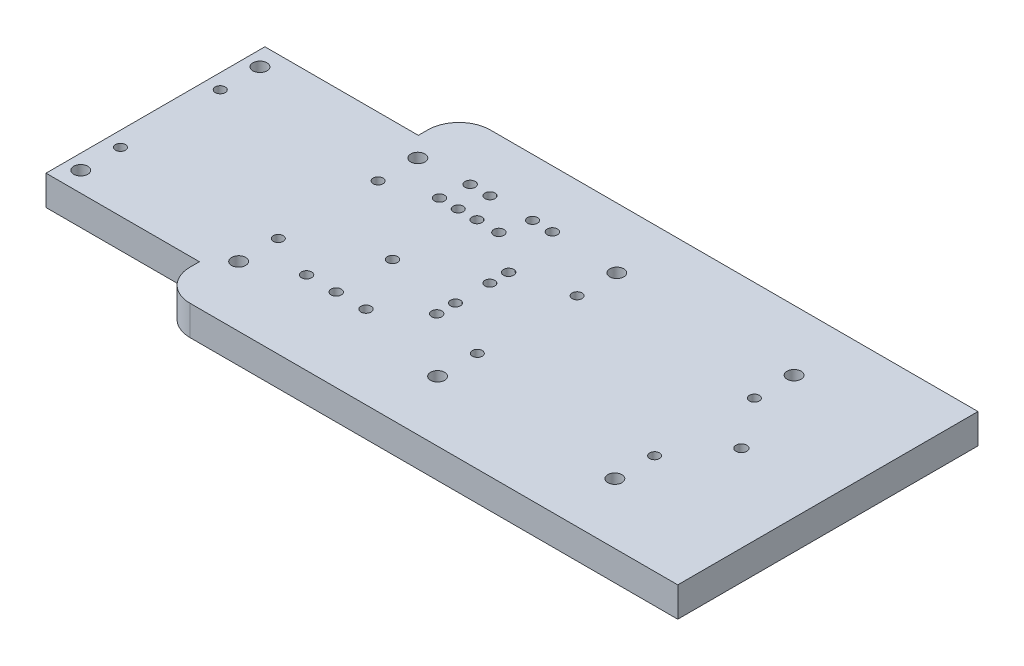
from build123d import *

# Parameters (mm, degrees)
SKETCH1_W                                      = 221.25
SKETCH1_H                                      = 100
BOSS_EXTRUDE1_DEPTH                            = 9.525
CUT_EXTRUDE3_REACH                             = 144.64
SKETCH4_W                                      = 53
SKETCH4_H                                      = 15
SKETCH5_W                                      = 70
SKETCH5_H                                      = 9.525
CUT_EXTRUDE4_DEPTH                             = 3.95
CUT_EXTRUDE5_REACH                             = 144.64
SKETCH6_W                                      = 168.25
SKETCH6_H                                      = 2
TAP_DRILL_FOR_8_32_TAP1_D                      = 3.4544
TAP_DRILL_FOR_8_32_TAP1_DEPTH                  = 6.35
TAP_DRILL_FOR_8_32_TAP1_TIP                    = 1.037806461
CBORE_FOR_8_SOCKET_HEAD_CAP_SCREW1_D           = 4.4958
CBORE_FOR_8_SOCKET_HEAD_CAP_SCREW1_CBORE_D     = 7.9375
CBORE_FOR_8_SOCKET_HEAD_CAP_SCREW1_CBORE_DEPTH = 4.1656
F_1_8_0_125_PRESS_DOWEL_HOLE1_D                = 3.175
TAP_DRILL_FOR_8_32_TAP2_D                      = 3.4544
TAP_DRILL_FOR_8_32_TAP2_DEPTH                  = 6.35
TAP_DRILL_FOR_8_32_TAP2_TIP                    = 1.037806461
CBORE_FOR_4_SOCKET_HEAD_CAP_SCREW1_D           = 3.2639
CBORE_FOR_4_SOCKET_HEAD_CAP_SCREW1_CBORE_D     = 5.55752
CBORE_FOR_4_SOCKET_HEAD_CAP_SCREW1_CBORE_DEPTH = 2.8448
F_1_8_0_125_PRESS_DOWEL_HOLE2_D                = 3.175
F_1_8_0_125_PRESS_DOWEL_HOLE3_D                = 3.175
CBORE_FOR_4_SOCKET_HEAD_CAP_SCREW2_D           = 3.2639
CBORE_FOR_4_SOCKET_HEAD_CAP_SCREW2_CBORE_D     = 5.55752
CBORE_FOR_4_SOCKET_HEAD_CAP_SCREW2_CBORE_DEPTH = 2.8448
CBORE_FOR_4_SOCKET_HEAD_CAP_SCREW3_D           = 3.2639
CBORE_FOR_4_SOCKET_HEAD_CAP_SCREW3_CBORE_D     = 5.55752
CBORE_FOR_4_SOCKET_HEAD_CAP_SCREW3_CBORE_DEPTH = 2.8448
CBORE_FOR_4_SOCKET_HEAD_CAP_SCREW4_D           = 3.2639
CBORE_FOR_4_SOCKET_HEAD_CAP_SCREW4_CBORE_D     = 5.55752
CBORE_FOR_4_SOCKET_HEAD_CAP_SCREW4_CBORE_DEPTH = 2.8448
F_1_8_0_125_PRESS_DOWEL_HOLE4_D                = 3.175
FILLET1_R                                      = 10
SKETCH75_W                                     = 2.3
SKETCH75_H                                     = 96
CUT_EXTRUDE6_DEPTH                             = 10


with BuildPart() as part:
    # Sketch1 → Boss-Extrude1 (new body)
    with BuildSketch(Plane(origin=(0, 0, 0), x_dir=(1, 0, 0), z_dir=(0, 1, 0))):
        with Locations((22.625, 0)):
            Rectangle(SKETCH1_W, SKETCH1_H)
    extrude(amount=BOSS_EXTRUDE1_DEPTH)

    # Sketch4 → Cut-Extrude3 (cut, up to next)
    with BuildSketch(Plane(origin=(0, 9.525, 0), x_dir=(1, 0, 0), z_dir=(0, 1, 0)), mode=Mode.PRIVATE) as cut_extrude3_sk1:
        with Locations((-61.5, 42.5)):
            Rectangle(SKETCH4_W, SKETCH4_H)
    cut_extrude3_tool1 = extrude(cut_extrude3_sk1.sketch, amount=-CUT_EXTRUDE3_REACH, mode=Mode.PRIVATE) & part.part
    # Sketch4 → Cut-Extrude3 (cut, up to next)
    with BuildSketch(Plane(origin=(0, 9.525, 0), x_dir=(1, 0, 0), z_dir=(0, 1, 0)), mode=Mode.PRIVATE) as cut_extrude3_sk2:
        with Locations((-61.5, -42.5)):
            Rectangle(SKETCH4_W, SKETCH4_H)
    cut_extrude3_tool2 = extrude(cut_extrude3_sk2.sketch, amount=-CUT_EXTRUDE3_REACH, mode=Mode.PRIVATE) & part.part
    add(cut_extrude3_tool1.solids().sort_by_distance((-61.5, 9.525, -42.5))[0], mode=Mode.SUBTRACT)
    add(cut_extrude3_tool2.solids().sort_by_distance((-61.5, 9.525, 42.5))[0], mode=Mode.SUBTRACT)

    # Sketch5 → Cut-Extrude4 (cut)
    with BuildSketch(Plane.ZY.offset(88)):
        with Locations((0, 4.7625)):
            Rectangle(SKETCH5_W, SKETCH5_H)
    extrude(amount=-CUT_EXTRUDE4_DEPTH, mode=Mode.SUBTRACT)

    # Sketch6 → Cut-Extrude5 (cut, up to next)
    with BuildSketch(Plane(origin=(0, 9.525, 0), x_dir=(1, 0, 0), z_dir=(0, 1, 0)), mode=Mode.PRIVATE) as cut_extrude5_sk1:
        with Locations((49.125, 49)):
            Rectangle(SKETCH6_W, SKETCH6_H)
    cut_extrude5_tool1 = extrude(cut_extrude5_sk1.sketch, amount=-CUT_EXTRUDE5_REACH, mode=Mode.PRIVATE) & part.part
    # Sketch6 → Cut-Extrude5 (cut, up to next)
    with BuildSketch(Plane(origin=(0, 9.525, 0), x_dir=(1, 0, 0), z_dir=(0, 1, 0)), mode=Mode.PRIVATE) as cut_extrude5_sk2:
        with Locations((49.125, -49)):
            Rectangle(SKETCH6_W, SKETCH6_H)
    cut_extrude5_tool2 = extrude(cut_extrude5_sk2.sketch, amount=-CUT_EXTRUDE5_REACH, mode=Mode.PRIVATE) & part.part
    add(cut_extrude5_tool1.solids().sort_by_distance((49.125, 9.525, -49))[0], mode=Mode.SUBTRACT)
    add(cut_extrude5_tool2.solids().sort_by_distance((49.125, 9.525, 49))[0], mode=Mode.SUBTRACT)

    # Tap Drill for _8-32 Tap1
    with Locations(Plane(origin=(0, 0, 0), x_dir=(-1, 0, 0), z_dir=(0, -1, 0))):
        with Locations((54.05, 0), (-73.25, 0)):
            Hole(TAP_DRILL_FOR_8_32_TAP1_D / 2, depth=TAP_DRILL_FOR_8_32_TAP1_DEPTH)
            with Locations((0, 0, -(TAP_DRILL_FOR_8_32_TAP1_DEPTH + TAP_DRILL_FOR_8_32_TAP1_TIP / 2))):  # 118° drill point
                Cone(0, TAP_DRILL_FOR_8_32_TAP1_D / 2, TAP_DRILL_FOR_8_32_TAP1_TIP, mode=Mode.SUBTRACT)

    # CBORE for _8 Socket Head Cap Screw1 (through all)
    with Locations(Plane(origin=(0, 0, 0), x_dir=(-1, 0, 0), z_dir=(0, -1, 0))):
        with Locations((79.2875, -28.65), (79.2875, 28.65), (28.8075, -28.65), (28.8075, 28.65), (-34.81, -28.65), (-91.49, -28.65), (-91.49, 28.65), (-34.81, 28.65)):
            CounterBoreHole(CBORE_FOR_8_SOCKET_HEAD_CAP_SCREW1_D / 2, CBORE_FOR_8_SOCKET_HEAD_CAP_SCREW1_CBORE_D / 2, CBORE_FOR_8_SOCKET_HEAD_CAP_SCREW1_CBORE_DEPTH)

    # 1_8 _0.125_ Press Dowel Hole1 (through all)
    with Locations(Plane(origin=(0, 9.525, 0), x_dir=(1, 0, 0), z_dir=(0, 1, 0))):
        with Locations((-79.2875, -15.95), (-79.2875, 15.95), (-28.8075, 15.95), (-28.8075, -15.95), (34.81, 15.95), (34.81, -15.95), (91.49, -15.95), (91.49, 15.95)):
            Hole(F_1_8_0_125_PRESS_DOWEL_HOLE1_D / 2)

    # Tap Drill for _8-32 Tap2
    with Locations(Plane(origin=(0, 9.525, 0), x_dir=(1, 0, 0), z_dir=(0, 1, 0))):
        with Locations((103.3, 0)):
            Hole(TAP_DRILL_FOR_8_32_TAP2_D / 2, depth=TAP_DRILL_FOR_8_32_TAP2_DEPTH)
            with Locations((0, 0, -(TAP_DRILL_FOR_8_32_TAP2_DEPTH + TAP_DRILL_FOR_8_32_TAP2_TIP / 2))):  # 118° drill point
                Cone(0, TAP_DRILL_FOR_8_32_TAP2_D / 2, TAP_DRILL_FOR_8_32_TAP2_TIP, mode=Mode.SUBTRACT)

    # CBORE for _4 Socket Head Cap Screw1 (through all)
    with Locations(Plane(origin=(0, 0, 0), x_dir=(-1, 0, 0), z_dir=(0, -1, 0))):
        with Locations((-17.37, 11.5), (-17.37, -11.5)):
            CounterBoreHole(CBORE_FOR_4_SOCKET_HEAD_CAP_SCREW1_D / 2, CBORE_FOR_4_SOCKET_HEAD_CAP_SCREW1_CBORE_D / 2, CBORE_FOR_4_SOCKET_HEAD_CAP_SCREW1_CBORE_DEPTH)

    # 1_8 _0.125_ Press Dowel Hole2 (through all)
    with Locations(Plane(origin=(0, 0, 0), x_dir=(-1, 0, 0), z_dir=(0, -1, 0))):
        with Locations((-17.37, 5.5), (-17.37, -5.5)):
            Hole(F_1_8_0_125_PRESS_DOWEL_HOLE2_D / 2)

    # 1_8 _0.125_ Press Dowel Hole3 (through all)
    with Locations(Plane(origin=(0, 0, 0), x_dir=(-1, 0, 0), z_dir=(0, -1, 0))):
        with Locations((2.24, 21), (8.24, 21)):
            Hole(F_1_8_0_125_PRESS_DOWEL_HOLE3_D / 2)

    # CBORE for _4 Socket Head Cap Screw2 (through all)
    with Locations(Plane(origin=(0, 0, 0), x_dir=(-1, 0, 0), z_dir=(0, -1, 0))):
        with Locations((-4.76, 21), (14.24, 21), (14.24, -21.5), (-4.76, -21.5)):
            CounterBoreHole(CBORE_FOR_4_SOCKET_HEAD_CAP_SCREW2_D / 2, CBORE_FOR_4_SOCKET_HEAD_CAP_SCREW2_CBORE_D / 2, CBORE_FOR_4_SOCKET_HEAD_CAP_SCREW2_CBORE_DEPTH)

    # CBORE for _4 Socket Head Cap Screw3 (through all)
    with Locations(Plane(origin=(0, 0, 0), x_dir=(-1, 0, 0), z_dir=(0, -1, 0))):
        with Locations((4.74, -21.52), (4.74, -3.52)):
            CounterBoreHole(CBORE_FOR_4_SOCKET_HEAD_CAP_SCREW3_D / 2, CBORE_FOR_4_SOCKET_HEAD_CAP_SCREW3_CBORE_D / 2, CBORE_FOR_4_SOCKET_HEAD_CAP_SCREW3_CBORE_DEPTH)

    # CBORE for _4 Socket Head Cap Screw4 (through all)
    with Locations(Plane(origin=(0, 0, 0), x_dir=(-1, 0, 0), z_dir=(0, -1, 0))):
        with Locations((13.14, 29.705), (-13.16, 29.705)):
            CounterBoreHole(CBORE_FOR_4_SOCKET_HEAD_CAP_SCREW4_D / 2, CBORE_FOR_4_SOCKET_HEAD_CAP_SCREW4_CBORE_D / 2, CBORE_FOR_4_SOCKET_HEAD_CAP_SCREW4_CBORE_DEPTH)

    # 1_8 _0.125_ Press Dowel Hole4 (through all)
    with Locations(Plane(origin=(0, 0, 0), x_dir=(-1, 0, 0), z_dir=(0, -1, 0))):
        with Locations((-6.81, 29.705), (6.79, 29.705)):
            Hole(F_1_8_0_125_PRESS_DOWEL_HOLE4_D / 2)

    # Fillet1
    fillet1_edges = [part.edges().sort_by_distance(p)[0] for p in [
        (-35, 4.7625, -48),
        (-35, 4.7625, 48),
    ]]
    fillet(fillet1_edges, radius=FILLET1_R)

    # Sketch75 → Cut-Extrude6 (cut)
    with BuildSketch(Plane(origin=(0, 9.525, 0), x_dir=(1, 0, 0), z_dir=(0, 1, 0))):
        with Locations((132.1, 0)):
            Rectangle(SKETCH75_W, SKETCH75_H)
    extrude(amount=-CUT_EXTRUDE6_DEPTH, mode=Mode.SUBTRACT)


solid = part.part
